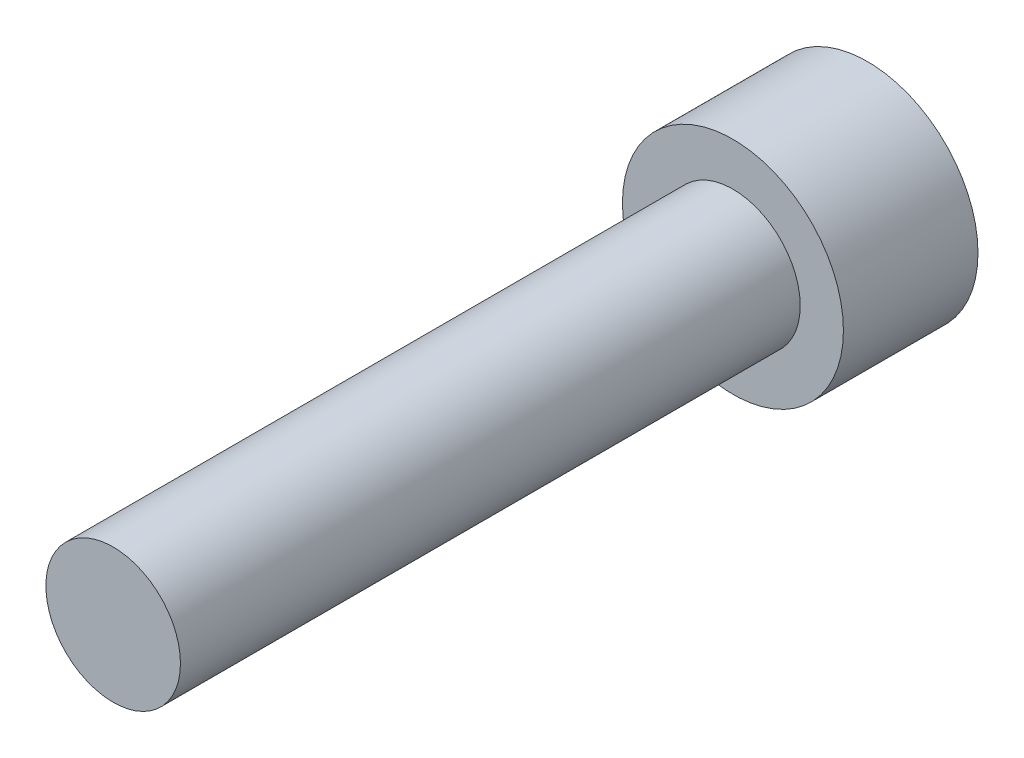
from build123d import *

# Parameters (mm, degrees)
HEX_2_DEPTH = 3.048


with BuildPart() as part:
    # Sketch6 → Revolve1 (revolve)
    with BuildSketch(Plane(origin=(0, 0, 0), x_dir=(0, 0, -1), z_dir=(1, 0, 0)), mode=Mode.PRIVATE) as revolve1_sk:
        Polygon((-22.225, 0), (-22.225, -2.413), (0, -2.413), (0, -3.9624), (4.826, -3.9624), (4.826, 0), align=None)
    revolve(revolve1_sk.sketch.rotate(Axis((0, 0, 22.225), (0, 0, -1)), 270), axis=Axis((0, 0, 22.225), (0, 0, -1)))

    # Sketch7 → HEX 2 (cut)
    with BuildSketch(Plane(origin=(0, 0, -4.826), x_dir=(-1, 0, 0), z_dir=(0, 0, -1))):
        Polygon((-1.9812, 1.143846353), (-1.9812, -1.143846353), (0, -2.287692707), (1.9812, -1.143846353), (1.9812, 1.143846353), (0, 2.287692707), align=None)
    extrude(amount=-HEX_2_DEPTH, mode=Mode.SUBTRACT)


solid = part.part
